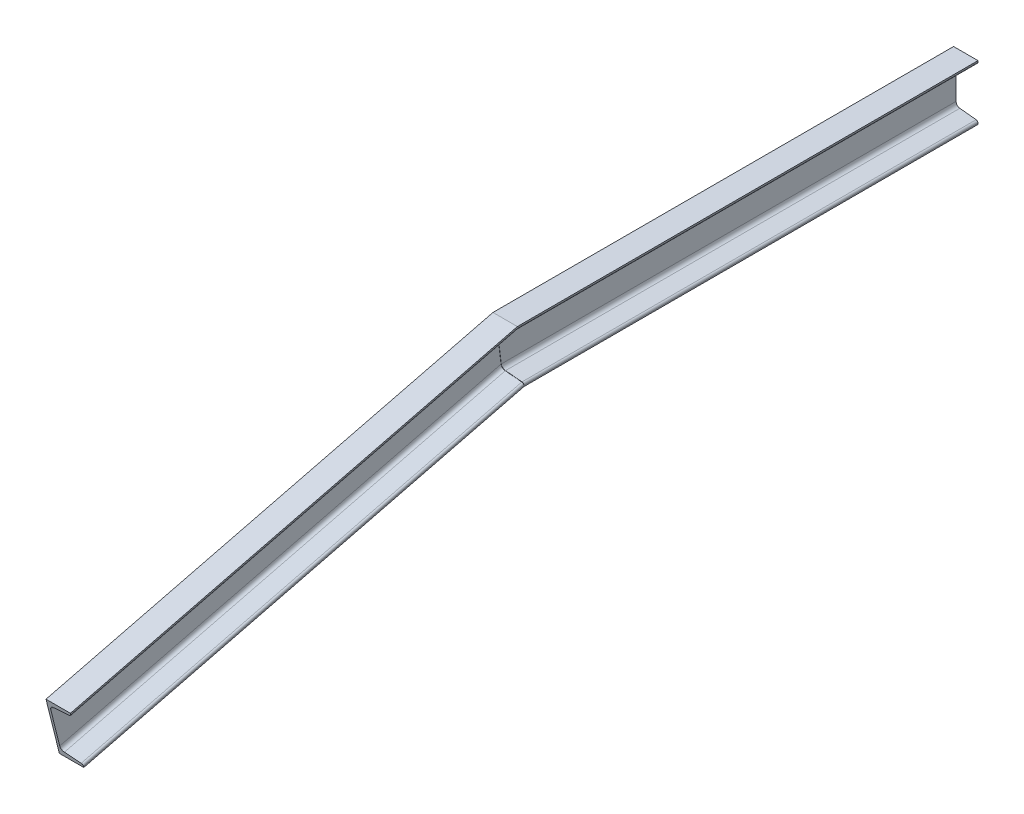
from build123d import *

# Parameters (mm, degrees)
EXTRUDE_1_DEPTH     = 1000
EXTRUDE_2_DEPTH     = 1000
CUT_EXTRUDE_1_DEPTH = 1000
CUT_EXTRUDE_2_REACH = 1973.868
CUT_EXTRUDE_START   = -987.477203
CUT_EXTRUDE_3_DEPTH = 16.50783


with BuildPart() as part:
    # Sketch 1 → Extrude 1 (new body)
    with BuildSketch(Plane.XY):
        with BuildLine():
            Line((0, 60), (0, -60))
            Line((0, -60), (53, -60))
            Line((53, -60), (53, -57.551177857))
            ThreePointArc((53, -57.551177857), (51.844388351, -54.540352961), (48.97108153, -53.075903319))
            Line((48.97108153, -53.075903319), (13.557836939, -49.348193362))
            ThreePointArc((13.557836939, -49.348193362), (7.811223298, -46.419294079), (5.5, -40.397644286))
            Line((5.5, -40.397644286), (5.5, 40.397644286))
            ThreePointArc((5.5, 40.397644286), (7.811223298, 46.419294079), (13.557836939, 49.348193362))
            Line((13.557836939, 49.348193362), (48.97108153, 53.075903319))
            ThreePointArc((48.97108153, 53.075903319), (51.844388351, 54.540352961), (53, 57.551177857))
            Line((53, 57.551177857), (53, 60))
            Line((53, 60), (0, 60))
        make_face()
    extrude(amount=EXTRUDE_1_DEPTH)

    # Sketch 2 → Extrude 2 (add)
    with BuildSketch(Plane(origin=(0, -231.224209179, 927.389649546), x_dir=(-1, 0, 0), z_dir=(0, 0.24192189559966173, -0.970295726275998))):
        with BuildLine():
            Line((0, 300.139639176), (-53, 300.139639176))
            Line((-53, 300.139639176), (-53, 297.690817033))
            ThreePointArc((-53, 297.690817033), (-51.844388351, 294.679992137), (-48.97108153, 293.215542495))
            Line((-48.97108153, 293.215542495), (-13.557836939, 289.487832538))
            ThreePointArc((-13.557836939, 289.487832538), (-7.811223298, 286.558933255), (-5.5, 280.537283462))
            Line((-5.5, 280.537283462), (-5.5, 199.74199489))
            ThreePointArc((-5.5, 199.74199489), (-7.811223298, 193.720345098), (-13.557836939, 190.791445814))
            Line((-13.557836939, 190.791445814), (-48.97108153, 187.063735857))
            ThreePointArc((-48.97108153, 187.063735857), (-51.844388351, 185.599286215), (-53, 182.588461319))
            Line((-53, 182.588461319), (-53, 180.139639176))
            Line((-53, 180.139639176), (0, 180.139639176))
            Line((0, 180.139639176), (0, 300.139639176))
        make_face()
    extrude(amount=-EXTRUDE_2_DEPTH)

    # Sketch 3 → Cut-Extrude 1 (cut)
    with BuildSketch(Plane.ZY):
        Polygon((998.733634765, 51.327384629), (981.961522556, -85.27050753), (982.358541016, -85.319255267), (999.130653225, 51.278636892), align=None)
    extrude(amount=-CUT_EXTRUDE_1_DEPTH, mode=Mode.SUBTRACT)

    # Cut-Extrude 2: up to this plane
    cut_extrude_2_end = Plane(origin=(1000, -85.319255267, 982.358541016), z_dir=(0, -0.12186934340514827, 0.9925461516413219))
    # Sketch 4 → Cut-Extrude 2 (cut, up to the surface)
    with BuildSketch(Plane(origin=(0, -473.146104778, 1897.685375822), x_dir=(1, 0, 0), z_dir=(0, -0.2419218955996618, 0.9702957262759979)), mode=Mode.PRIVATE) as cut_extrude_2_sk1:
        with BuildLine():
            Line((53, 297.690817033), (53, 182.588461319))
            ThreePointArc((53, 182.588461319), (51.844388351, 185.599286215), (48.97108153, 187.063735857))
            Line((48.97108153, 187.063735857), (13.557836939, 190.791445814))
            ThreePointArc((13.557836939, 190.791445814), (7.811223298, 193.720345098), (5.5, 199.74199489))
            Line((5.5, 199.74199489), (5.5, 280.537283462))
            ThreePointArc((5.5, 280.537283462), (7.811223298, 286.558933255), (13.557836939, 289.487832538))
            Line((13.557836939, 289.487832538), (48.97108153, 293.215542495))
            ThreePointArc((48.97108153, 293.215542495), (51.844388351, 294.679992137), (53, 297.690817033))
        make_face()
    cut_extrude_2_tool1 = split(extrude(cut_extrude_2_sk1.sketch, amount=-CUT_EXTRUDE_2_REACH, mode=Mode.PRIVATE), bisect_by=cut_extrude_2_end, keep=Keep.BOTH, mode=Mode.PRIVATE)
    add(cut_extrude_2_tool1.solids().sort_by_distance((29.795271, -240.139639, 1955.780413))[0], mode=Mode.SUBTRACT)

    # Sketch 5 → Cut-Extrude 3 (cut)
    with BuildSketch(Plane(origin=(0, 0, 0), x_dir=(-1, 0, 0), z_dir=(0, 0, -1)).offset(CUT_EXTRUDE_START)):
        with BuildLine():
            Line((-53, 57.551177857), (-53, -57.551177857))
            ThreePointArc((-53, -57.551177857), (-51.844388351, -54.540352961), (-48.97108153, -53.075903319))
            Line((-48.97108153, -53.075903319), (-13.557836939, -49.348193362))
            ThreePointArc((-13.557836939, -49.348193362), (-7.811223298, -46.419294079), (-5.5, -40.397644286))
            Line((-5.5, -40.397644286), (-5.5, 40.397644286))
            ThreePointArc((-5.5, 40.397644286), (-7.811223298, 46.419294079), (-13.557836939, 49.348193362))
            Line((-13.557836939, 49.348193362), (-48.97108153, 53.075903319))
            ThreePointArc((-48.97108153, 53.075903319), (-51.844388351, 54.540352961), (-53, 57.551177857))
        make_face()
    extrude(amount=CUT_EXTRUDE_3_DEPTH, mode=Mode.SUBTRACT)


solid = part.part
